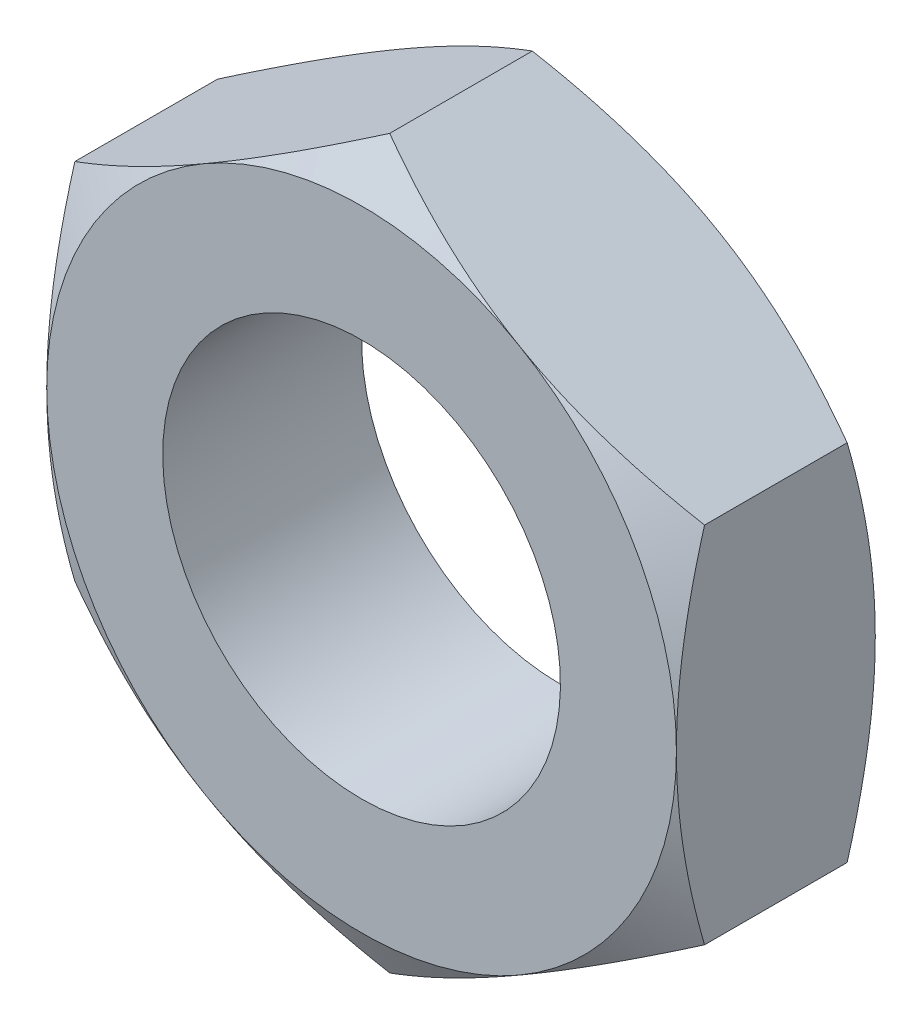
ISO-10303-21;
HEADER;
FILE_DESCRIPTION(('STEP AP214'),'2;1');
FILE_NAME('part.step','',(''),(''),'','','');
FILE_SCHEMA(('AUTOMOTIVE_DESIGN { 1 0 10303 214 1 1 1 1 }'));
ENDSEC;
DATA;
#1=APPLICATION_CONTEXT('core data for automotive mechanical design processes');
#2=APPLICATION_PROTOCOL_DEFINITION('international standard','automotive_design',2000,#1);
#3=PRODUCT_CONTEXT('',#1,'mechanical');
#4=PRODUCT('Part','Part','',(#3));
#5=PRODUCT_RELATED_PRODUCT_CATEGORY('part','',(#4));
#6=PRODUCT_DEFINITION_FORMATION('','',#4);
#7=PRODUCT_DEFINITION_CONTEXT('part definition',#1,'design');
#8=PRODUCT_DEFINITION('design','',#6,#7);
#9=PRODUCT_DEFINITION_SHAPE('','',#8);
#10=(LENGTH_UNIT() NAMED_UNIT(*) SI_UNIT(.MILLI.,.METRE.));
#11=(NAMED_UNIT(*) PLANE_ANGLE_UNIT() SI_UNIT($,.RADIAN.));
#12=(NAMED_UNIT(*) SI_UNIT($,.STERADIAN.) SOLID_ANGLE_UNIT());
#13=UNCERTAINTY_MEASURE_WITH_UNIT(LENGTH_MEASURE(1.E-05),#10,'distance_accuracy_value','');
#14=(GEOMETRIC_REPRESENTATION_CONTEXT(3) GLOBAL_UNCERTAINTY_ASSIGNED_CONTEXT((#13)) GLOBAL_UNIT_ASSIGNED_CONTEXT((#10,
#11,#12)) REPRESENTATION_CONTEXT('',''));
#15=CARTESIAN_POINT('',(0.,0.,0.));
#16=DIRECTION('',(0.,0.,1.));
#17=DIRECTION('',(1.,0.,0.));
#18=AXIS2_PLACEMENT_3D('',#15,#16,#17);
#19=CARTESIAN_POINT('',(6.,0.,0.));
#20=DIRECTION('',(0.,0.,-1.));
#21=DIRECTION('',(0.,1.,0.));
#22=AXIS2_PLACEMENT_3D('',#19,#20,#21);
#23=PLANE('',#22);
#24=CARTESIAN_POINT('',(0.,0.,0.));
#25=DIRECTION('',(0.,0.,-1.));
#26=DIRECTION('',(0.,1.,0.));
#27=AXIS2_PLACEMENT_3D('',#24,#25,#26);
#28=CIRCLE('',#27,6.);
#29=CARTESIAN_POINT('',(0.,6.,0.));
#30=VERTEX_POINT('',#29);
#31=EDGE_CURVE('E109',#30,#30,#28,.T.);
#32=ORIENTED_EDGE('',*,*,#31,.F.);
#33=EDGE_LOOP('',(#32));
#34=FACE_BOUND('',#33,.T.);
#35=CARTESIAN_POINT('',(0.,0.,0.));
#36=DIRECTION('',(0.,0.,1.));
#37=DIRECTION('',(-1.,0.,0.));
#38=AXIS2_PLACEMENT_3D('',#35,#36,#37);
#39=CIRCLE('',#38,9.5);
#40=CARTESIAN_POINT('',(-4.75,8.22724133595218,0.));
#41=VERTEX_POINT('',#40);
#42=CARTESIAN_POINT('',(-9.5,0.,0.));
#43=VERTEX_POINT('',#42);
#44=EDGE_CURVE('E415',#41,#43,#39,.T.);
#45=ORIENTED_EDGE('',*,*,#44,.F.);
#46=CARTESIAN_POINT('',(0.,0.,0.));
#47=DIRECTION('',(0.,0.,1.));
#48=DIRECTION('',(0.,-1.,0.));
#49=AXIS2_PLACEMENT_3D('',#46,#47,#48);
#50=CIRCLE('',#49,9.5);
#51=CARTESIAN_POINT('',(4.75,8.22724133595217,0.));
#52=VERTEX_POINT('',#51);
#53=EDGE_CURVE('E104',#52,#41,#50,.T.);
#54=ORIENTED_EDGE('',*,*,#53,.F.);
#55=CARTESIAN_POINT('',(0.,0.,0.));
#56=DIRECTION('',(0.,0.,1.));
#57=DIRECTION('',(-1.,0.,0.));
#58=AXIS2_PLACEMENT_3D('',#55,#56,#57);
#59=CIRCLE('',#58,9.5);
#60=CARTESIAN_POINT('',(9.5,0.,0.));
#61=VERTEX_POINT('',#60);
#62=EDGE_CURVE('E17',#61,#52,#59,.T.);
#63=ORIENTED_EDGE('',*,*,#62,.F.);
#64=CARTESIAN_POINT('',(0.,0.,0.));
#65=DIRECTION('',(0.,0.,1.));
#66=DIRECTION('',(-1.,0.,0.));
#67=AXIS2_PLACEMENT_3D('',#64,#65,#66);
#68=CIRCLE('',#67,9.5);
#69=CARTESIAN_POINT('',(4.75,-8.22724133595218,0.));
#70=VERTEX_POINT('',#69);
#71=EDGE_CURVE('E101',#70,#61,#68,.T.);
#72=ORIENTED_EDGE('',*,*,#71,.F.);
#73=CARTESIAN_POINT('',(0.,0.,0.));
#74=DIRECTION('',(0.,0.,1.));
#75=DIRECTION('',(0.,-1.,0.));
#76=AXIS2_PLACEMENT_3D('',#73,#74,#75);
#77=CIRCLE('',#76,9.5);
#78=CARTESIAN_POINT('',(-4.75,-8.22724133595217,0.));
#79=VERTEX_POINT('',#78);
#80=EDGE_CURVE('E119',#79,#70,#77,.T.);
#81=ORIENTED_EDGE('',*,*,#80,.F.);
#82=CARTESIAN_POINT('',(0.,0.,0.));
#83=DIRECTION('',(0.,0.,1.));
#84=DIRECTION('',(-1.,0.,0.));
#85=AXIS2_PLACEMENT_3D('',#82,#83,#84);
#86=CIRCLE('',#85,9.5);
#87=EDGE_CURVE('E417',#43,#79,#86,.T.);
#88=ORIENTED_EDGE('',*,*,#87,.F.);
#89=EDGE_LOOP('',(#45,#54,#63,#72,#81,#88));
#90=FACE_BOUND('',#89,.T.);
#91=ADVANCED_FACE('F14',(#34,#90),#23,.T.);
#92=CARTESIAN_POINT('',(0.,0.,0.853596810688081));
#93=DIRECTION('',(0.,0.,1.));
#94=DIRECTION('',(-1.,0.,0.));
#95=AXIS2_PLACEMENT_3D('',#92,#93,#94);
#96=CONICAL_SURFACE('',#95,10.9784730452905,1.0471975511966);
#97=CARTESIAN_POINT('',(9.5,5.48482755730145,0.848505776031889));
#98=CARTESIAN_POINT('',(9.11335202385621,5.70805887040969,0.719590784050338));
#99=CARTESIAN_POINT('',(8.72360763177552,5.93307790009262,0.601482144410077));
#100=CARTESIAN_POINT('',(7.94068328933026,6.38509947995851,0.393199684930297));
#101=CARTESIAN_POINT('',(7.54753064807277,6.61208626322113,0.302887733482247));
#102=CARTESIAN_POINT('',(6.954091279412,6.95470864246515,0.191999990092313));
#103=CARTESIAN_POINT('',(6.75552851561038,7.06934890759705,0.159120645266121));
#104=CARTESIAN_POINT('',(6.35745238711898,7.29917826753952,0.102205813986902));
#105=CARTESIAN_POINT('',(6.15793904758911,7.41436734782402,0.0781700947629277));
#106=CARTESIAN_POINT('',(5.75722379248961,7.6457204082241,0.0393648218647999));
#107=CARTESIAN_POINT('',(5.55601842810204,7.76188637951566,0.0246423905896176));
#108=CARTESIAN_POINT('',(5.15321199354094,7.99444678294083,0.00493960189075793));
#109=CARTESIAN_POINT('',(4.95161085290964,8.11084125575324,-3.88261459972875E-05));
#110=CARTESIAN_POINT('',(4.75,8.22724133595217,0.));
#111=B_SPLINE_CURVE_WITH_KNOTS('',3,(#97,#98,#99,#100,#101,#102,#103,#104,#105,#106,#107,#108,
#109,#110),.UNSPECIFIED.,.F.,.F.,(4,2,2,2,2,2,4),(0.,1.39466965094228,2.78229242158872,
3.47701423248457,4.17171775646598,4.86990873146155,5.56823793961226),.UNSPECIFIED.);
#112=CARTESIAN_POINT('',(9.5,5.48482755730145,0.848505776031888));
#113=VERTEX_POINT('',#112);
#114=EDGE_CURVE('E124',#113,#52,#111,.T.);
#115=ORIENTED_EDGE('',*,*,#114,.F.);
#116=CARTESIAN_POINT('',(9.5,0.,0.));
#117=CARTESIAN_POINT('',(9.5,0.232800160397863,-3.88261460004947E-05));
#118=CARTESIAN_POINT('',(9.5,0.465589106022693,0.00493960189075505));
#119=CARTESIAN_POINT('',(9.5,0.930709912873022,0.0246423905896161));
#120=CARTESIAN_POINT('',(9.5,1.16304185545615,0.0393648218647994));
#121=CARTESIAN_POINT('',(9.5,1.62574797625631,0.0781700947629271));
#122=CARTESIAN_POINT('',(9.5,1.8561261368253,0.1022058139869));
#123=CARTESIAN_POINT('',(9.5,2.31578485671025,0.159120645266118));
#124=CARTESIAN_POINT('',(9.5,2.54506538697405,0.191999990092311));
#125=CARTESIAN_POINT('',(9.5,3.23031014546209,0.302887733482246));
#126=CARTESIAN_POINT('',(9.5,3.68428371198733,0.393199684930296));
#127=CARTESIAN_POINT('',(9.5,4.5883268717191,0.601482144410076));
#128=CARTESIAN_POINT('',(9.5,5.03836493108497,0.719590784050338));
#129=CARTESIAN_POINT('',(9.5,5.48482755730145,0.848505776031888));
#130=B_SPLINE_CURVE_WITH_KNOTS('',3,(#116,#117,#118,#119,#120,#121,#122,#123,#124,#125,#126,
#127,#128,#129),.UNSPECIFIED.,.F.,.F.,(4,2,2,2,2,2,4),(0.,0.698329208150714,1.39652018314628,
2.09122370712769,2.78594551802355,4.17356828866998,5.56823793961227),.UNSPECIFIED.);
#131=EDGE_CURVE('E121',#61,#113,#130,.T.);
#132=ORIENTED_EDGE('',*,*,#131,.F.);
#133=ORIENTED_EDGE('',*,*,#62,.T.);
#134=EDGE_LOOP('',(#115,#132,#133));
#135=FACE_BOUND('',#134,.T.);
#136=ADVANCED_FACE('F122',(#135),#96,.T.);
#137=CARTESIAN_POINT('',(0.,0.,0.853596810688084));
#138=DIRECTION('',(0.,0.,1.));
#139=DIRECTION('',(0.,-1.,0.));
#140=AXIS2_PLACEMENT_3D('',#137,#138,#139);
#141=CONICAL_SURFACE('',#140,10.9784730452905,1.0471975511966);
#142=CARTESIAN_POINT('',(0.,10.9696551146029,0.848505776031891));
#143=CARTESIAN_POINT('',(-0.386647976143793,10.7464238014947,0.719590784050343));
#144=CARTESIAN_POINT('',(-0.776392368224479,10.5214047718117,0.601482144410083));
#145=CARTESIAN_POINT('',(-1.55931671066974,10.0693831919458,0.393199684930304));
#146=CARTESIAN_POINT('',(-1.95246935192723,9.84239640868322,0.302887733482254));
#147=CARTESIAN_POINT('',(-2.545908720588,9.4997740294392,0.191999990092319));
#148=CARTESIAN_POINT('',(-2.74447148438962,9.3851337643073,0.159120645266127));
#149=CARTESIAN_POINT('',(-3.14254761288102,9.15530440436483,0.102205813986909));
#150=CARTESIAN_POINT('',(-3.34206095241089,9.04011532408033,0.0781700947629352));
#151=CARTESIAN_POINT('',(-3.74277620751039,8.80876226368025,0.0393648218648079));
#152=CARTESIAN_POINT('',(-3.94398157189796,8.69259629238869,0.0246423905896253));
#153=CARTESIAN_POINT('',(-4.34678800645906,8.46003588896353,0.00493960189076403));
#154=CARTESIAN_POINT('',(-4.54838914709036,8.34364141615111,-3.88261459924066E-05));
#155=CARTESIAN_POINT('',(-4.75,8.22724133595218,0.));
#156=B_SPLINE_CURVE_WITH_KNOTS('',3,(#142,#143,#144,#145,#146,#147,#148,#149,#150,#151,#152,
#153,#154,#155),.UNSPECIFIED.,.F.,.F.,(4,2,2,2,2,2,4),(0.,1.39466965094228,2.78229242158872,
3.47701423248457,4.17171775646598,4.86990873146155,5.56823793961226),.UNSPECIFIED.);
#157=CARTESIAN_POINT('',(0.,10.9696551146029,0.848505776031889));
#158=VERTEX_POINT('',#157);
#159=EDGE_CURVE('E294',#158,#41,#156,.T.);
#160=ORIENTED_EDGE('',*,*,#159,.F.);
#161=CARTESIAN_POINT('',(4.75,8.22724133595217,0.));
#162=CARTESIAN_POINT('',(4.54838914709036,8.3436414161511,-3.88261459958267E-05));
#163=CARTESIAN_POINT('',(4.34678800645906,8.46003588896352,0.00493960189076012));
#164=CARTESIAN_POINT('',(3.94398157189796,8.69259629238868,0.0246423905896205));
#165=CARTESIAN_POINT('',(3.74277620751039,8.80876226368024,0.0393648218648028));
#166=CARTESIAN_POINT('',(3.34206095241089,9.04011532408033,0.0781700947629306));
#167=CARTESIAN_POINT('',(3.14254761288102,9.15530440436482,0.102205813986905));
#168=CARTESIAN_POINT('',(2.74447148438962,9.38513376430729,0.159120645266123));
#169=CARTESIAN_POINT('',(2.545908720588,9.49977402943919,0.191999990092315));
#170=CARTESIAN_POINT('',(1.95246935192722,9.84239640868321,0.30288773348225));
#171=CARTESIAN_POINT('',(1.55931671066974,10.0693831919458,0.393199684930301));
#172=CARTESIAN_POINT('',(0.776392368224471,10.5214047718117,0.601482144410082));
#173=CARTESIAN_POINT('',(0.386647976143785,10.7464238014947,0.719590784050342));
#174=CARTESIAN_POINT('',(0.,10.9696551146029,0.848505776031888));
#175=B_SPLINE_CURVE_WITH_KNOTS('',3,(#161,#162,#163,#164,#165,#166,#167,#168,#169,#170,#171,
#172,#173,#174),.UNSPECIFIED.,.F.,.F.,(4,2,2,2,2,2,4),(0.,0.698329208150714,1.39652018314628,
2.09122370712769,2.78594551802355,4.17356828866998,5.56823793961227),.UNSPECIFIED.);
#176=EDGE_CURVE('E302',#52,#158,#175,.T.);
#177=ORIENTED_EDGE('',*,*,#176,.F.);
#178=ORIENTED_EDGE('',*,*,#53,.T.);
#179=EDGE_LOOP('',(#160,#177,#178));
#180=FACE_BOUND('',#179,.T.);
#181=ADVANCED_FACE('F283',(#180),#141,.T.);
#182=CARTESIAN_POINT('',(0.,0.,0.853596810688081));
#183=DIRECTION('',(0.,0.,1.));
#184=DIRECTION('',(-1.,0.,0.));
#185=AXIS2_PLACEMENT_3D('',#182,#183,#184);
#186=CONICAL_SURFACE('',#185,10.9784730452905,1.0471975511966);
#187=CARTESIAN_POINT('',(-9.5,5.48482755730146,0.848505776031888));
#188=CARTESIAN_POINT('',(-9.5,5.03836493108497,0.719590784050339));
#189=CARTESIAN_POINT('',(-9.5,4.58832687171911,0.601482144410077));
#190=CARTESIAN_POINT('',(-9.5,3.68428371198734,0.393199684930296));
#191=CARTESIAN_POINT('',(-9.5,3.23031014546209,0.302887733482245));
#192=CARTESIAN_POINT('',(-9.5,2.54506538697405,0.19199999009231));
#193=CARTESIAN_POINT('',(-9.5,2.31578485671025,0.159120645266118));
#194=CARTESIAN_POINT('',(-9.5,1.8561261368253,0.1022058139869));
#195=CARTESIAN_POINT('',(-9.5,1.62574797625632,0.0781700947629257));
#196=CARTESIAN_POINT('',(-9.5,1.16304185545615,0.0393648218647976));
#197=CARTESIAN_POINT('',(-9.5,0.930709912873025,0.0246423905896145));
#198=CARTESIAN_POINT('',(-9.5,0.465589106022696,0.00493960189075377));
#199=CARTESIAN_POINT('',(-9.5,0.232800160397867,-3.88261460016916E-05));
#200=CARTESIAN_POINT('',(-9.5,0.,0.));
#201=B_SPLINE_CURVE_WITH_KNOTS('',3,(#187,#188,#189,#190,#191,#192,#193,#194,#195,#196,#197,
#198,#199,#200),.UNSPECIFIED.,.F.,.F.,(4,2,2,2,2,2,4),(0.,1.39466965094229,2.78229242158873,
3.47701423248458,4.17171775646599,4.86990873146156,5.56823793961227),.UNSPECIFIED.);
#202=CARTESIAN_POINT('',(-9.5,5.48482755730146,0.848505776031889));
#203=VERTEX_POINT('',#202);
#204=EDGE_CURVE('E262',#203,#43,#201,.T.);
#205=ORIENTED_EDGE('',*,*,#204,.F.);
#206=CARTESIAN_POINT('',(-4.75,8.22724133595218,0.));
#207=CARTESIAN_POINT('',(-4.95161085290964,8.11084125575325,-3.88261459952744E-05));
#208=CARTESIAN_POINT('',(-5.15321199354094,7.99444678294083,0.00493960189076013));
#209=CARTESIAN_POINT('',(-5.55601842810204,7.76188637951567,0.0246423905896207));
#210=CARTESIAN_POINT('',(-5.75722379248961,7.64572040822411,0.0393648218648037));
#211=CARTESIAN_POINT('',(-6.15793904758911,7.41436734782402,0.0781700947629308));
#212=CARTESIAN_POINT('',(-6.35745238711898,7.29917826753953,0.102205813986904));
#213=CARTESIAN_POINT('',(-6.75552851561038,7.06934890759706,0.159120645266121));
#214=CARTESIAN_POINT('',(-6.95409127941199,6.95470864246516,0.191999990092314));
#215=CARTESIAN_POINT('',(-7.54753064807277,6.61208626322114,0.302887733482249));
#216=CARTESIAN_POINT('',(-7.94068328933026,6.38509947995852,0.393199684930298));
#217=CARTESIAN_POINT('',(-8.72360763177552,5.93307790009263,0.601482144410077));
#218=CARTESIAN_POINT('',(-9.11335202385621,5.7080588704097,0.719590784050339));
#219=CARTESIAN_POINT('',(-9.5,5.48482755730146,0.848505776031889));
#220=B_SPLINE_CURVE_WITH_KNOTS('',3,(#206,#207,#208,#209,#210,#211,#212,#213,#214,#215,#216,
#217,#218,#219),.UNSPECIFIED.,.F.,.F.,(4,2,2,2,2,2,4),(0.,0.698329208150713,1.39652018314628,
2.09122370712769,2.78594551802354,4.17356828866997,5.56823793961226),.UNSPECIFIED.);
#221=EDGE_CURVE('E287',#41,#203,#220,.T.);
#222=ORIENTED_EDGE('',*,*,#221,.F.);
#223=ORIENTED_EDGE('',*,*,#44,.T.);
#224=EDGE_LOOP('',(#205,#222,#223));
#225=FACE_BOUND('',#224,.T.);
#226=ADVANCED_FACE('F277',(#225),#186,.T.);
#227=CARTESIAN_POINT('',(0.,0.,0.853596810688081));
#228=DIRECTION('',(0.,0.,1.));
#229=DIRECTION('',(-1.,0.,0.));
#230=AXIS2_PLACEMENT_3D('',#227,#228,#229);
#231=CONICAL_SURFACE('',#230,10.9784730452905,1.0471975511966);
#232=CARTESIAN_POINT('',(-9.5,0.,0.));
#233=CARTESIAN_POINT('',(-9.5,-0.232800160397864,-3.88261460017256E-05));
#234=CARTESIAN_POINT('',(-9.5,-0.465589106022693,0.00493960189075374));
#235=CARTESIAN_POINT('',(-9.5,-0.930709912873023,0.0246423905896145));
#236=CARTESIAN_POINT('',(-9.5,-1.16304185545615,0.0393648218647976));
#237=CARTESIAN_POINT('',(-9.5,-1.62574797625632,0.0781700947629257));
#238=CARTESIAN_POINT('',(-9.5,-1.8561261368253,0.1022058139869));
#239=CARTESIAN_POINT('',(-9.5,-2.31578485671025,0.159120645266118));
#240=CARTESIAN_POINT('',(-9.5,-2.54506538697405,0.19199999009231));
#241=CARTESIAN_POINT('',(-9.5,-3.23031014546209,0.302887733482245));
#242=CARTESIAN_POINT('',(-9.5,-3.68428371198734,0.393199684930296));
#243=CARTESIAN_POINT('',(-9.5,-4.58832687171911,0.601482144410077));
#244=CARTESIAN_POINT('',(-9.5,-5.03836493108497,0.719590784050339));
#245=CARTESIAN_POINT('',(-9.5,-5.48482755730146,0.848505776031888));
#246=B_SPLINE_CURVE_WITH_KNOTS('',3,(#232,#233,#234,#235,#236,#237,#238,#239,#240,#241,#242,
#243,#244,#245),.UNSPECIFIED.,.F.,.F.,(4,2,2,2,2,2,4),(0.,0.698329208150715,1.39652018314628,
2.09122370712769,2.78594551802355,4.17356828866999,5.56823793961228),.UNSPECIFIED.);
#247=CARTESIAN_POINT('',(-9.5,-5.48482755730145,0.848505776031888));
#248=VERTEX_POINT('',#247);
#249=EDGE_CURVE('E255',#43,#248,#246,.T.);
#250=ORIENTED_EDGE('',*,*,#249,.F.);
#251=ORIENTED_EDGE('',*,*,#87,.T.);
#252=CARTESIAN_POINT('',(-9.5,-5.48482755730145,0.848505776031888));
#253=CARTESIAN_POINT('',(-9.11335202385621,-5.70805887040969,0.719590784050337));
#254=CARTESIAN_POINT('',(-8.72360763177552,-5.93307790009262,0.601482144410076));
#255=CARTESIAN_POINT('',(-7.94068328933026,-6.38509947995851,0.393199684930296));
#256=CARTESIAN_POINT('',(-7.54753064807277,-6.61208626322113,0.302887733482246));
#257=CARTESIAN_POINT('',(-6.954091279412,-6.95470864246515,0.191999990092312));
#258=CARTESIAN_POINT('',(-6.75552851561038,-7.06934890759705,0.159120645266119));
#259=CARTESIAN_POINT('',(-6.35745238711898,-7.29917826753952,0.102205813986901));
#260=CARTESIAN_POINT('',(-6.15793904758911,-7.41436734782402,0.0781700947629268));
#261=CARTESIAN_POINT('',(-5.75722379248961,-7.6457204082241,0.0393648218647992));
#262=CARTESIAN_POINT('',(-5.55601842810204,-7.76188637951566,0.0246423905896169));
#263=CARTESIAN_POINT('',(-5.15321199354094,-7.99444678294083,0.00493960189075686));
#264=CARTESIAN_POINT('',(-4.95161085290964,-8.11084125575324,-3.88261459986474E-05));
#265=CARTESIAN_POINT('',(-4.75,-8.22724133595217,0.));
#266=B_SPLINE_CURVE_WITH_KNOTS('',3,(#252,#253,#254,#255,#256,#257,#258,#259,#260,#261,#262,
#263,#264,#265),.UNSPECIFIED.,.F.,.F.,(4,2,2,2,2,2,4),(0.,1.39466965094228,2.78229242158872,
3.47701423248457,4.17171775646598,4.86990873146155,5.56823793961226),.UNSPECIFIED.);
#267=EDGE_CURVE('E263',#248,#79,#266,.T.);
#268=ORIENTED_EDGE('',*,*,#267,.F.);
#269=EDGE_LOOP('',(#250,#251,#268));
#270=FACE_BOUND('',#269,.T.);
#271=ADVANCED_FACE('F274',(#270),#231,.T.);
#272=CARTESIAN_POINT('',(0.,0.,0.853596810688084));
#273=DIRECTION('',(0.,0.,1.));
#274=DIRECTION('',(0.,-1.,0.));
#275=AXIS2_PLACEMENT_3D('',#272,#273,#274);
#276=CONICAL_SURFACE('',#275,10.9784730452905,1.0471975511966);
#277=CARTESIAN_POINT('',(0.,-10.9696551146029,0.848505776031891));
#278=CARTESIAN_POINT('',(0.386647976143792,-10.7464238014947,0.719590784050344));
#279=CARTESIAN_POINT('',(0.776392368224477,-10.5214047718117,0.601482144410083));
#280=CARTESIAN_POINT('',(1.55931671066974,-10.0693831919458,0.393199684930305));
#281=CARTESIAN_POINT('',(1.95246935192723,-9.84239640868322,0.302887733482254));
#282=CARTESIAN_POINT('',(2.545908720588,-9.4997740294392,0.191999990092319));
#283=CARTESIAN_POINT('',(2.74447148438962,-9.3851337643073,0.159120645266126));
#284=CARTESIAN_POINT('',(3.14254761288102,-9.15530440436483,0.102205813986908));
#285=CARTESIAN_POINT('',(3.34206095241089,-9.04011532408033,0.0781700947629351));
#286=CARTESIAN_POINT('',(3.74277620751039,-8.80876226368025,0.039364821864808));
#287=CARTESIAN_POINT('',(3.94398157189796,-8.69259629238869,0.0246423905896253));
#288=CARTESIAN_POINT('',(4.34678800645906,-8.46003588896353,0.0049396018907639));
#289=CARTESIAN_POINT('',(4.54838914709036,-8.34364141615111,-3.88261459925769E-05));
#290=CARTESIAN_POINT('',(4.75,-8.22724133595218,0.));
#291=B_SPLINE_CURVE_WITH_KNOTS('',3,(#277,#278,#279,#280,#281,#282,#283,#284,#285,#286,#287,
#288,#289,#290),.UNSPECIFIED.,.F.,.F.,(4,2,2,2,2,2,4),(0.,1.39466965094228,2.78229242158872,
3.47701423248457,4.17171775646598,4.86990873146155,5.56823793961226),.UNSPECIFIED.);
#292=CARTESIAN_POINT('',(0.,-10.9696551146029,0.848505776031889));
#293=VERTEX_POINT('',#292);
#294=EDGE_CURVE('E163',#293,#70,#291,.T.);
#295=ORIENTED_EDGE('',*,*,#294,.F.);
#296=CARTESIAN_POINT('',(-4.75,-8.22724133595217,0.));
#297=CARTESIAN_POINT('',(-4.54838914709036,-8.3436414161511,-3.88261459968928E-05));
#298=CARTESIAN_POINT('',(-4.34678800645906,-8.46003588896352,0.00493960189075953));
#299=CARTESIAN_POINT('',(-3.94398157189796,-8.69259629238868,0.0246423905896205));
#300=CARTESIAN_POINT('',(-3.74277620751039,-8.80876226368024,0.0393648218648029));
#301=CARTESIAN_POINT('',(-3.34206095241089,-9.04011532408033,0.0781700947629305));
#302=CARTESIAN_POINT('',(-3.14254761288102,-9.15530440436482,0.102205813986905));
#303=CARTESIAN_POINT('',(-2.74447148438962,-9.38513376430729,0.159120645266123));
#304=CARTESIAN_POINT('',(-2.545908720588,-9.49977402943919,0.191999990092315));
#305=CARTESIAN_POINT('',(-1.95246935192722,-9.84239640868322,0.30288773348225));
#306=CARTESIAN_POINT('',(-1.55931671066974,-10.0693831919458,0.393199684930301));
#307=CARTESIAN_POINT('',(-0.776392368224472,-10.5214047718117,0.601482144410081));
#308=CARTESIAN_POINT('',(-0.386647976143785,-10.7464238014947,0.719590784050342));
#309=CARTESIAN_POINT('',(0.,-10.9696551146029,0.848505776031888));
#310=B_SPLINE_CURVE_WITH_KNOTS('',3,(#296,#297,#298,#299,#300,#301,#302,#303,#304,#305,#306,
#307,#308,#309),.UNSPECIFIED.,.F.,.F.,(4,2,2,2,2,2,4),(0.,0.698329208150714,1.39652018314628,
2.09122370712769,2.78594551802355,4.17356828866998,5.56823793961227),.UNSPECIFIED.);
#311=EDGE_CURVE('E368',#79,#293,#310,.T.);
#312=ORIENTED_EDGE('',*,*,#311,.F.);
#313=ORIENTED_EDGE('',*,*,#80,.T.);
#314=EDGE_LOOP('',(#295,#312,#313));
#315=FACE_BOUND('',#314,.T.);
#316=ADVANCED_FACE('F150',(#315),#276,.T.);
#317=CARTESIAN_POINT('',(0.,0.,0.853596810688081));
#318=DIRECTION('',(0.,0.,1.));
#319=DIRECTION('',(-1.,0.,0.));
#320=AXIS2_PLACEMENT_3D('',#317,#318,#319);
#321=CONICAL_SURFACE('',#320,10.9784730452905,1.0471975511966);
#322=CARTESIAN_POINT('',(9.5,-5.48482755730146,0.848505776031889));
#323=CARTESIAN_POINT('',(9.5,-5.03836493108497,0.71959078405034));
#324=CARTESIAN_POINT('',(9.5,-4.58832687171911,0.601482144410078));
#325=CARTESIAN_POINT('',(9.5,-3.68428371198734,0.393199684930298));
#326=CARTESIAN_POINT('',(9.5,-3.23031014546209,0.302887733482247));
#327=CARTESIAN_POINT('',(9.5,-2.54506538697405,0.191999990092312));
#328=CARTESIAN_POINT('',(9.5,-2.31578485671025,0.159120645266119));
#329=CARTESIAN_POINT('',(9.5,-1.8561261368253,0.102205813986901));
#330=CARTESIAN_POINT('',(9.5,-1.62574797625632,0.0781700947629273));
#331=CARTESIAN_POINT('',(9.5,-1.16304185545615,0.0393648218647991));
#332=CARTESIAN_POINT('',(9.5,-0.930709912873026,0.0246423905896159));
#333=CARTESIAN_POINT('',(9.5,-0.465589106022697,0.00493960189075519));
#334=CARTESIAN_POINT('',(9.5,-0.232800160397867,-3.88261460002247E-05));
#335=CARTESIAN_POINT('',(9.5,0.,0.));
#336=B_SPLINE_CURVE_WITH_KNOTS('',3,(#322,#323,#324,#325,#326,#327,#328,#329,#330,#331,#332,
#333,#334,#335),.UNSPECIFIED.,.F.,.F.,(4,2,2,2,2,2,4),(0.,1.39466965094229,2.78229242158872,
3.47701423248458,4.17171775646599,4.86990873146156,5.56823793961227),.UNSPECIFIED.);
#337=CARTESIAN_POINT('',(9.5,-5.48482755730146,0.848505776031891));
#338=VERTEX_POINT('',#337);
#339=EDGE_CURVE('E114',#338,#61,#336,.T.);
#340=ORIENTED_EDGE('',*,*,#339,.F.);
#341=CARTESIAN_POINT('',(4.75,-8.22724133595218,0.));
#342=CARTESIAN_POINT('',(4.95161085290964,-8.11084125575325,-3.88261459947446E-05));
#343=CARTESIAN_POINT('',(5.15321199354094,-7.99444678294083,0.00493960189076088));
#344=CARTESIAN_POINT('',(5.55601842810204,-7.76188637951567,0.0246423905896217));
#345=CARTESIAN_POINT('',(5.75722379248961,-7.64572040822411,0.0393648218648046));
#346=CARTESIAN_POINT('',(6.15793904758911,-7.41436734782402,0.0781700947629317));
#347=CARTESIAN_POINT('',(6.35745238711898,-7.29917826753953,0.102205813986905));
#348=CARTESIAN_POINT('',(6.75552851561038,-7.06934890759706,0.159120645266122));
#349=CARTESIAN_POINT('',(6.95409127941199,-6.95470864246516,0.191999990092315));
#350=CARTESIAN_POINT('',(7.54753064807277,-6.61208626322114,0.30288773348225));
#351=CARTESIAN_POINT('',(7.94068328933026,-6.38509947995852,0.3931996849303));
#352=CARTESIAN_POINT('',(8.72360763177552,-5.93307790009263,0.601482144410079));
#353=CARTESIAN_POINT('',(9.11335202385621,-5.7080588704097,0.719590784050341));
#354=CARTESIAN_POINT('',(9.5,-5.48482755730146,0.848505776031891));
#355=B_SPLINE_CURVE_WITH_KNOTS('',3,(#341,#342,#343,#344,#345,#346,#347,#348,#349,#350,#351,
#352,#353,#354),.UNSPECIFIED.,.F.,.F.,(4,2,2,2,2,2,4),(0.,0.698329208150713,1.39652018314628,
2.09122370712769,2.78594551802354,4.17356828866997,5.56823793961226),.UNSPECIFIED.);
#356=EDGE_CURVE('E117',#70,#338,#355,.T.);
#357=ORIENTED_EDGE('',*,*,#356,.F.);
#358=ORIENTED_EDGE('',*,*,#71,.T.);
#359=EDGE_LOOP('',(#340,#357,#358));
#360=FACE_BOUND('',#359,.T.);
#361=ADVANCED_FACE('F112',(#360),#321,.T.);
#362=CARTESIAN_POINT('',(9.5,-5.48482755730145,0.));
#363=DIRECTION('',(1.,0.,0.));
#364=DIRECTION('',(0.,1.,0.));
#365=AXIS2_PLACEMENT_3D('',#362,#363,#364);
#366=PLANE('',#365);
#367=ORIENTED_EDGE('',*,*,#339,.T.);
#368=ORIENTED_EDGE('',*,*,#131,.T.);
#369=DIRECTION('',(0.,0.,1.));
#370=VECTOR('',#369,1.);
#371=CARTESIAN_POINT('',(9.5,5.48482755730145,0.));
#372=LINE('',#371,#370);
#373=CARTESIAN_POINT('',(9.50000001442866,5.48482754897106,5.15149421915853));
#374=VERTEX_POINT('',#373);
#375=EDGE_CURVE('E127',#374,#113,#372,.F.);
#376=ORIENTED_EDGE('',*,*,#375,.F.);
#377=CARTESIAN_POINT('',(9.5,0.,6.));
#378=CARTESIAN_POINT('',(9.5,0.23280015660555,6.0000388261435));
#379=CARTESIAN_POINT('',(9.5,0.465589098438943,5.99506039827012));
#380=CARTESIAN_POINT('',(9.5,0.930709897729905,5.97535761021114));
#381=CARTESIAN_POINT('',(9.5,1.16304183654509,5.96063517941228));
#382=CARTESIAN_POINT('',(9.5,1.62574794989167,5.92182990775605));
#383=CARTESIAN_POINT('',(9.5,1.85612610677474,5.89779418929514));
#384=CARTESIAN_POINT('',(9.5,2.31578481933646,5.84087935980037));
#385=CARTESIAN_POINT('',(9.5,2.54506534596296,5.8080000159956));
#386=CARTESIAN_POINT('',(9.5,3.23031009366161,5.6971122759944));
#387=CARTESIAN_POINT('',(9.5,3.68428365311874,5.60680032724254));
#388=CARTESIAN_POINT('',(9.5,4.58832679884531,5.39851787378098));
#389=CARTESIAN_POINT('',(9.5,5.03836485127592,5.28040923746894));
#390=CARTESIAN_POINT('',(9.5,5.48482747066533,5.15149424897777));
#391=B_SPLINE_CURVE_WITH_KNOTS('',3,(#377,#378,#379,#380,#381,#382,#383,#384,#385,#386,#387,
#388,#389,#390),.UNSPECIFIED.,.F.,.F.,(4,2,2,2,2,2,4),(0.,0.698329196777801,1.39652016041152,
2.09122367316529,2.78594547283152,4.17356822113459,5.5682378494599),.UNSPECIFIED.);
#392=CARTESIAN_POINT('',(9.5,0.,6.));
#393=VERTEX_POINT('',#392);
#394=EDGE_CURVE('E348',#393,#374,#391,.T.);
#395=ORIENTED_EDGE('',*,*,#394,.F.);
#396=CARTESIAN_POINT('',(9.49999996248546,-5.48482758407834,5.15149419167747));
#397=CARTESIAN_POINT('',(9.49999998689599,-5.03836495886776,5.28040919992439));
#398=CARTESIAN_POINT('',(9.49999999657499,-4.58832689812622,5.39851784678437));
#399=CARTESIAN_POINT('',(9.50000000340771,-3.68428373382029,5.6068003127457));
#400=CARTESIAN_POINT('',(9.50000000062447,-3.23031016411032,5.69711226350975));
#401=CARTESIAN_POINT('',(9.49999999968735,-2.54506540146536,5.80800000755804));
#402=CARTESIAN_POINT('',(9.49999999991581,-2.31578487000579,5.84087935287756));
#403=CARTESIAN_POINT('',(9.50000000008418,-1.85612614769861,5.89779418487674));
#404=CARTESIAN_POINT('',(9.5000000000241,-1.62574798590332,5.92182990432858));
#405=CARTESIAN_POINT('',(9.49999999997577,-1.16304186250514,5.9606351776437));
#406=CARTESIAN_POINT('',(9.49999999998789,-0.930709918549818,5.97535760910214));
#407=CARTESIAN_POINT('',(9.50000000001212,-0.465589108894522,5.9950603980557));
#408=CARTESIAN_POINT('',(9.50000000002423,-0.232800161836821,6.00003882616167));
#409=CARTESIAN_POINT('',(9.5,0.,6.));
#410=B_SPLINE_CURVE_WITH_KNOTS('',3,(#396,#397,#398,#399,#400,#401,#402,#403,#404,#405,#406,
#407,#408,#409),.UNSPECIFIED.,.F.,.F.,(4,2,2,2,2,2,4),(0.,1.39466966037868,2.78229243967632,
3.4770142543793,4.17171778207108,4.86990876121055,5.5682379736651),.UNSPECIFIED.);
#411=CARTESIAN_POINT('',(9.5,-5.48482757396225,5.15149421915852));
#412=VERTEX_POINT('',#411);
#413=EDGE_CURVE('E354',#412,#393,#410,.T.);
#414=ORIENTED_EDGE('',*,*,#413,.F.);
#415=DIRECTION('',(0.,0.,1.));
#416=VECTOR('',#415,1.);
#417=CARTESIAN_POINT('',(9.5,-5.48482755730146,0.));
#418=LINE('',#417,#416);
#419=EDGE_CURVE('E131',#338,#412,#418,.T.);
#420=ORIENTED_EDGE('',*,*,#419,.F.);
#421=EDGE_LOOP('',(#367,#368,#376,#395,#414,#420));
#422=FACE_BOUND('',#421,.T.);
#423=ADVANCED_FACE('F129',(#422),#366,.T.);
#424=CARTESIAN_POINT('',(9.5,5.48482755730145,0.));
#425=DIRECTION('',(0.5,0.866025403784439,0.));
#426=DIRECTION('',(-0.866025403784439,0.5,0.));
#427=AXIS2_PLACEMENT_3D('',#424,#425,#426);
#428=PLANE('',#427);
#429=ORIENTED_EDGE('',*,*,#114,.T.);
#430=ORIENTED_EDGE('',*,*,#176,.T.);
#431=DIRECTION('',(0.,0.,1.));
#432=VECTOR('',#431,1.);
#433=CARTESIAN_POINT('',(0.,10.9696551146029,0.));
#434=LINE('',#433,#432);
#435=CARTESIAN_POINT('',(-1.15429505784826E-08,10.9696551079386,5.15149422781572));
#436=VERTEX_POINT('',#435);
#437=EDGE_CURVE('E301',#436,#158,#434,.F.);
#438=ORIENTED_EDGE('',*,*,#437,.F.);
#439=CARTESIAN_POINT('',(4.75,8.22724133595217,6.));
#440=CARTESIAN_POINT('',(4.54838914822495,8.34364141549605,6.00003882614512));
#441=CARTESIAN_POINT('',(4.34678800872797,8.46003588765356,5.99506039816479));
#442=CARTESIAN_POINT('',(3.94398157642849,8.69259628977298,5.97535760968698));
#443=CARTESIAN_POINT('',(3.74277621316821,8.8087622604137,5.96063517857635));
#444=CARTESIAN_POINT('',(3.34206096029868,9.04011531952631,5.92182990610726));
#445=CARTESIAN_POINT('',(3.14254762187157,9.15530439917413,5.89779418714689));
#446=CARTESIAN_POINT('',(2.74447149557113,9.38513375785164,5.84087935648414));
#447=CARTESIAN_POINT('',(2.54590873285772,9.49977402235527,5.80800001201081));
#448=CARTESIAN_POINT('',(1.95246936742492,9.84239639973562,5.69711226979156));
#449=CARTESIAN_POINT('',(1.55931672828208,10.0693831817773,5.60680031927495));
#450=CARTESIAN_POINT('',(0.776392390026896,10.5214047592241,5.39851786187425));
#451=CARTESIAN_POINT('',(0.386648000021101,10.7464237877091,5.28040922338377));
#452=CARTESIAN_POINT('',(2.59198323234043E-08,10.9696550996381,5.15149423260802));
#453=B_SPLINE_CURVE_WITH_KNOTS('',3,(#439,#440,#441,#442,#443,#444,#445,#446,#447,#448,#449,
#450,#451,#452),.UNSPECIFIED.,.F.,.F.,(4,2,2,2,2,2,4),(0.,0.698329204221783,1.39652017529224,
2.0912236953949,2.78594550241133,4.17356826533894,5.56823790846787),.UNSPECIFIED.);
#454=CARTESIAN_POINT('',(4.75,8.22724133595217,6.));
#455=VERTEX_POINT('',#454);
#456=EDGE_CURVE('E326',#455,#436,#453,.T.);
#457=ORIENTED_EDGE('',*,*,#456,.F.);
#458=CARTESIAN_POINT('',(9.50000000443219,5.48482751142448,5.15149419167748));
#459=CARTESIAN_POINT('',(9.1133520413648,5.7080588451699,5.28040919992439));
#460=CARTESIAN_POINT('',(8.72360765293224,5.93307788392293,5.39851784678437));
#461=CARTESIAN_POINT('',(7.940683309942,6.38509947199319,5.6068003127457));
#462=CARTESIAN_POINT('',(7.54753066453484,6.61208625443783,5.69711226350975));
#463=CARTESIAN_POINT('',(6.95409129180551,6.95470863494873,5.80800000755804));
#464=CARTESIAN_POINT('',(6.75552852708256,7.06934890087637,5.84087935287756));
#465=CARTESIAN_POINT('',(6.35745239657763,7.29917826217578,5.89779418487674));
#466=CARTESIAN_POINT('',(6.1579390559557,7.41436734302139,5.92182990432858));
#467=CARTESIAN_POINT('',(5.7572237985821,7.64572040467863,5.9606351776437));
#468=CARTESIAN_POINT('',(5.55601843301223,7.76188637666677,5.97535760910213));
#469=CARTESIAN_POINT('',(5.15321199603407,7.9944467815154,5.9950603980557));
#470=CARTESIAN_POINT('',(4.95161085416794,8.11084125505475,6.00003882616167));
#471=CARTESIAN_POINT('',(4.75,8.22724133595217,6.));
#472=B_SPLINE_CURVE_WITH_KNOTS('',3,(#458,#459,#460,#461,#462,#463,#464,#465,#466,#467,#468,
#469,#470,#471),.UNSPECIFIED.,.F.,.F.,(4,2,2,2,2,2,4),(0.,1.39466966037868,2.78229243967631,
3.47701425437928,4.17171778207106,4.86990876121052,5.56823797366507),.UNSPECIFIED.);
#473=EDGE_CURVE('E318',#374,#455,#472,.T.);
#474=ORIENTED_EDGE('',*,*,#473,.F.);
#475=ORIENTED_EDGE('',*,*,#375,.T.);
#476=EDGE_LOOP('',(#429,#430,#438,#457,#474,#475));
#477=FACE_BOUND('',#476,.T.);
#478=ADVANCED_FACE('F311',(#477),#428,.T.);
#479=CARTESIAN_POINT('',(0.,10.9696551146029,0.));
#480=DIRECTION('',(-0.5,0.866025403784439,0.));
#481=DIRECTION('',(-0.866025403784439,-0.5,0.));
#482=AXIS2_PLACEMENT_3D('',#479,#480,#481);
#483=PLANE('',#482);
#484=ORIENTED_EDGE('',*,*,#159,.T.);
#485=ORIENTED_EDGE('',*,*,#221,.T.);
#486=DIRECTION('',(0.,0.,1.));
#487=VECTOR('',#486,1.);
#488=CARTESIAN_POINT('',(-9.5,5.48482755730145,0.));
#489=LINE('',#488,#487);
#490=CARTESIAN_POINT('',(-9.5,5.48482757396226,5.15149421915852));
#491=VERTEX_POINT('',#490);
#492=EDGE_CURVE('E293',#491,#203,#489,.F.);
#493=ORIENTED_EDGE('',*,*,#492,.F.);
#494=CARTESIAN_POINT('',(-4.75,8.22724133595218,6.));
#495=CARTESIAN_POINT('',(-4.9516108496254,8.11084125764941,6.0000388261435));
#496=CARTESIAN_POINT('',(-5.15321198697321,7.99444678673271,5.99506039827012));
#497=CARTESIAN_POINT('',(-5.5560184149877,7.76188638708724,5.97535761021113));
#498=CARTESIAN_POINT('',(-5.75722377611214,7.64572041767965,5.96063517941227));
#499=CARTESIAN_POINT('',(-6.15793902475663,7.41436736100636,5.92182990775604));
#500=CARTESIAN_POINT('',(-6.35745236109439,7.29917828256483,5.89779418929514));
#501=CARTESIAN_POINT('',(-6.75552848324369,7.06934892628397,5.84087935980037));
#502=CARTESIAN_POINT('',(-6.95409124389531,6.95470866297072,5.8080000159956));
#503=CARTESIAN_POINT('',(-7.54753060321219,6.61208628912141,5.69711227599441));
#504=CARTESIAN_POINT('',(-7.9406832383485,6.38509950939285,5.60680032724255));
#505=CARTESIAN_POINT('',(-8.72360756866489,5.93307793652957,5.398517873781));
#506=CARTESIAN_POINT('',(-9.11335195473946,5.70805891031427,5.28040923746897));
#507=CARTESIAN_POINT('',(-9.49999992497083,5.48482760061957,5.1514942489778));
#508=B_SPLINE_CURVE_WITH_KNOTS('',3,(#494,#495,#496,#497,#498,#499,#500,#501,#502,#503,#504,
#505,#506,#507),.UNSPECIFIED.,.F.,.F.,(4,2,2,2,2,2,4),(0.,0.698329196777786,1.39652016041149,
2.09122367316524,2.78594547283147,4.17356822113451,5.56823784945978),.UNSPECIFIED.);
#509=CARTESIAN_POINT('',(-4.75,8.22724133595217,6.));
#510=VERTEX_POINT('',#509);
#511=EDGE_CURVE('E401',#510,#491,#508,.T.);
#512=ORIENTED_EDGE('',*,*,#511,.F.);
#513=CARTESIAN_POINT('',(-1.65412002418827E-08,10.9696550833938,5.15149422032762));
#514=CARTESIAN_POINT('',(-0.386647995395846,10.7464237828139,5.28040921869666));
#515=CARTESIAN_POINT('',(-0.776392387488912,10.521404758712,5.39851786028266));
#516=CARTESIAN_POINT('',(-1.55931672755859,10.0693831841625,5.60680031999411));
#517=CARTESIAN_POINT('',(-1.95246936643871,9.84239640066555,5.69711226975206));
#518=CARTESIAN_POINT('',(-2.54590873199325,9.49977402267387,5.8080000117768));
#519=CARTESIAN_POINT('',(-2.74447149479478,9.38513375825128,5.84087935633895));
#520=CARTESIAN_POINT('',(-3.14254762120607,9.15530439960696,5.89779418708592));
#521=CARTESIAN_POINT('',(-3.34206095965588,9.04011531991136,5.9218299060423));
#522=CARTESIAN_POINT('',(-3.74277621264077,8.80876226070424,5.96063517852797));
#523=CARTESIAN_POINT('',(-3.94398157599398,8.69259629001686,5.97535760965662));
#524=CARTESIAN_POINT('',(-4.34678800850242,8.46003588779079,5.9950603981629));
#525=CARTESIAN_POINT('',(-4.54838914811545,8.34364141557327,6.00003882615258));
#526=CARTESIAN_POINT('',(-4.75,8.22724133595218,6.));
#527=B_SPLINE_CURVE_WITH_KNOTS('',3,(#513,#514,#515,#516,#517,#518,#519,#520,#521,#522,#523,
#524,#525,#526),.UNSPECIFIED.,.F.,.F.,(4,2,2,2,2,2,4),(0.,1.39466964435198,2.78229240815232,
3.47701421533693,4.1717177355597,4.86990870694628,5.56823791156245),.UNSPECIFIED.);
#528=EDGE_CURVE('E333',#436,#510,#527,.T.);
#529=ORIENTED_EDGE('',*,*,#528,.F.);
#530=ORIENTED_EDGE('',*,*,#437,.T.);
#531=EDGE_LOOP('',(#484,#485,#493,#512,#529,#530));
#532=FACE_BOUND('',#531,.T.);
#533=ADVANCED_FACE('F247',(#532),#483,.T.);
#534=CARTESIAN_POINT('',(-9.5,5.48482755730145,0.));
#535=DIRECTION('',(-1.,0.,0.));
#536=DIRECTION('',(0.,-1.,0.));
#537=AXIS2_PLACEMENT_3D('',#534,#535,#536);
#538=PLANE('',#537);
#539=ORIENTED_EDGE('',*,*,#204,.T.);
#540=ORIENTED_EDGE('',*,*,#249,.T.);
#541=DIRECTION('',(0.,0.,1.));
#542=VECTOR('',#541,1.);
#543=CARTESIAN_POINT('',(-9.5,-5.48482755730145,0.));
#544=LINE('',#543,#542);
#545=CARTESIAN_POINT('',(-9.50000001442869,-5.48482754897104,5.15149421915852));
#546=VERTEX_POINT('',#545);
#547=EDGE_CURVE('E261',#546,#248,#544,.F.);
#548=ORIENTED_EDGE('',*,*,#547,.F.);
#549=CARTESIAN_POINT('',(-9.5,0.,6.));
#550=CARTESIAN_POINT('',(-9.5,-0.232800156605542,6.0000388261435));
#551=CARTESIAN_POINT('',(-9.5,-0.465589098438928,5.99506039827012));
#552=CARTESIAN_POINT('',(-9.5,-0.930709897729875,5.97535761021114));
#553=CARTESIAN_POINT('',(-9.5,-1.16304183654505,5.96063517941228));
#554=CARTESIAN_POINT('',(-9.5,-1.62574794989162,5.92182990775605));
#555=CARTESIAN_POINT('',(-9.5,-1.85612610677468,5.89779418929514));
#556=CARTESIAN_POINT('',(-9.5,-2.31578481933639,5.84087935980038));
#557=CARTESIAN_POINT('',(-9.5,-2.54506534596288,5.80800001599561));
#558=CARTESIAN_POINT('',(-9.5,-3.23031009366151,5.69711227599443));
#559=CARTESIAN_POINT('',(-9.5,-3.68428365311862,5.60680032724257));
#560=CARTESIAN_POINT('',(-9.5,-4.58832679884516,5.39851787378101));
#561=CARTESIAN_POINT('',(-9.5,-5.03836485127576,5.28040923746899));
#562=CARTESIAN_POINT('',(-9.5,-5.48482747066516,5.15149424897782));
#563=B_SPLINE_CURVE_WITH_KNOTS('',3,(#549,#550,#551,#552,#553,#554,#555,#556,#557,#558,#559,
#560,#561,#562),.UNSPECIFIED.,.F.,.F.,(4,2,2,2,2,2,4),(0.,0.698329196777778,1.39652016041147,
2.09122367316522,2.78594547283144,4.17356822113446,5.56823784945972),.UNSPECIFIED.);
#564=CARTESIAN_POINT('',(-9.5,0.,6.));
#565=VERTEX_POINT('',#564);
#566=EDGE_CURVE('E230',#565,#546,#563,.T.);
#567=ORIENTED_EDGE('',*,*,#566,.F.);
#568=CARTESIAN_POINT('',(-9.49999996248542,5.48482758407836,5.15149419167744));
#569=CARTESIAN_POINT('',(-9.49999998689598,5.03836495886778,5.28040919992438));
#570=CARTESIAN_POINT('',(-9.49999999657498,4.58832689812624,5.39851784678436));
#571=CARTESIAN_POINT('',(-9.50000000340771,3.68428373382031,5.60680031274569));
#572=CARTESIAN_POINT('',(-9.50000000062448,3.23031016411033,5.69711226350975));
#573=CARTESIAN_POINT('',(-9.49999999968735,2.54506540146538,5.80800000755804));
#574=CARTESIAN_POINT('',(-9.49999999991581,2.3157848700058,5.84087935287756));
#575=CARTESIAN_POINT('',(-9.50000000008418,1.85612614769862,5.89779418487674));
#576=CARTESIAN_POINT('',(-9.5000000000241,1.62574798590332,5.92182990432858));
#577=CARTESIAN_POINT('',(-9.49999999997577,1.16304186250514,5.9606351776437));
#578=CARTESIAN_POINT('',(-9.49999999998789,0.930709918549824,5.97535760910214));
#579=CARTESIAN_POINT('',(-9.50000000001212,0.465589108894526,5.9950603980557));
#580=CARTESIAN_POINT('',(-9.50000000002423,0.232800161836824,6.00003882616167));
#581=CARTESIAN_POINT('',(-9.5,0.,6.));
#582=B_SPLINE_CURVE_WITH_KNOTS('',3,(#568,#569,#570,#571,#572,#573,#574,#575,#576,#577,#578,
#579,#580,#581),.UNSPECIFIED.,.F.,.F.,(4,2,2,2,2,2,4),(0.,1.39466966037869,2.78229243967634,
3.47701425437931,4.1717177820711,4.86990876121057,5.56823797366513),.UNSPECIFIED.);
#583=EDGE_CURVE('E237',#491,#565,#582,.T.);
#584=ORIENTED_EDGE('',*,*,#583,.F.);
#585=ORIENTED_EDGE('',*,*,#492,.T.);
#586=EDGE_LOOP('',(#539,#540,#548,#567,#584,#585));
#587=FACE_BOUND('',#586,.T.);
#588=ADVANCED_FACE('F243',(#587),#538,.T.);
#589=CARTESIAN_POINT('',(-9.5,-5.48482755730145,0.));
#590=DIRECTION('',(-0.5,-0.866025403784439,0.));
#591=DIRECTION('',(0.866025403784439,-0.5,0.));
#592=AXIS2_PLACEMENT_3D('',#589,#590,#591);
#593=PLANE('',#592);
#594=ORIENTED_EDGE('',*,*,#267,.T.);
#595=ORIENTED_EDGE('',*,*,#311,.T.);
#596=DIRECTION('',(0.,0.,1.));
#597=VECTOR('',#596,1.);
#598=CARTESIAN_POINT('',(0.,-10.9696551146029,0.));
#599=LINE('',#598,#597);
#600=CARTESIAN_POINT('',(-1.44286764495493E-08,-10.9696551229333,5.15149421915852));
#601=VERTEX_POINT('',#600);
#602=EDGE_CURVE('E367',#601,#293,#599,.F.);
#603=ORIENTED_EDGE('',*,*,#602,.F.);
#604=CARTESIAN_POINT('',(-4.75,-8.22724133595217,6.));
#605=CARTESIAN_POINT('',(-4.5483891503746,-8.34364141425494,6.00003882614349));
#606=CARTESIAN_POINT('',(-4.34678801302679,-8.46003588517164,5.99506039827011));
#607=CARTESIAN_POINT('',(-3.9439815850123,-8.69259628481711,5.97535761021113));
#608=CARTESIAN_POINT('',(-3.74277622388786,-8.80876225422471,5.96063517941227));
#609=CARTESIAN_POINT('',(-3.34206097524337,-9.04011531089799,5.92182990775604));
#610=CARTESIAN_POINT('',(-3.1425476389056,-9.15530438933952,5.89779418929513));
#611=CARTESIAN_POINT('',(-2.7444715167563,-9.38513374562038,5.84087935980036));
#612=CARTESIAN_POINT('',(-2.54590875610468,-9.49977400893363,5.80800001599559));
#613=CARTESIAN_POINT('',(-1.9524693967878,-9.84239638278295,5.6971122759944));
#614=CARTESIAN_POINT('',(-1.55931676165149,-10.0693831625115,5.60680032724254));
#615=CARTESIAN_POINT('',(-0.776392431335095,-10.5214047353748,5.39851787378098));
#616=CARTESIAN_POINT('',(-0.386648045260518,-10.7464237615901,5.28040923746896));
#617=CARTESIAN_POINT('',(-7.50291483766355E-08,-10.9696550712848,5.1514942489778));
#618=B_SPLINE_CURVE_WITH_KNOTS('',3,(#604,#605,#606,#607,#608,#609,#610,#611,#612,#613,#614,
#615,#616,#617),.UNSPECIFIED.,.F.,.F.,(4,2,2,2,2,2,4),(0.,0.698329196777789,1.39652016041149,
2.09122367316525,2.78594547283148,4.17356822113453,5.56823784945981),.UNSPECIFIED.);
#619=CARTESIAN_POINT('',(-4.75,-8.22724133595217,6.));
#620=VERTEX_POINT('',#619);
#621=EDGE_CURVE('E32',#620,#601,#618,.T.);
#622=ORIENTED_EDGE('',*,*,#621,.F.);
#623=CARTESIAN_POINT('',(-9.5000000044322,-5.48482751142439,5.15149419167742));
#624=CARTESIAN_POINT('',(-9.11335204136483,-5.70805884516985,5.28040919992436));
#625=CARTESIAN_POINT('',(-8.72360765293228,-5.93307788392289,5.39851784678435));
#626=CARTESIAN_POINT('',(-7.94068330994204,-6.38509947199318,5.60680031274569));
#627=CARTESIAN_POINT('',(-7.54753066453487,-6.61208625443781,5.69711226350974));
#628=CARTESIAN_POINT('',(-6.95409129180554,-6.95470863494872,5.80800000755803));
#629=CARTESIAN_POINT('',(-6.75552852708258,-7.06934890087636,5.84087935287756));
#630=CARTESIAN_POINT('',(-6.35745239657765,-7.29917826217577,5.89779418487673));
#631=CARTESIAN_POINT('',(-6.15793905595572,-7.41436734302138,5.92182990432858));
#632=CARTESIAN_POINT('',(-5.75722379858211,-7.64572040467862,5.9606351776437));
#633=CARTESIAN_POINT('',(-5.55601843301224,-7.76188637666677,5.97535760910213));
#634=CARTESIAN_POINT('',(-5.15321199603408,-7.9944467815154,5.9950603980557));
#635=CARTESIAN_POINT('',(-4.95161085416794,-8.11084125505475,6.00003882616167));
#636=CARTESIAN_POINT('',(-4.75,-8.22724133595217,6.));
#637=B_SPLINE_CURVE_WITH_KNOTS('',3,(#623,#624,#625,#626,#627,#628,#629,#630,#631,#632,#633,
#634,#635,#636),.UNSPECIFIED.,.F.,.F.,(4,2,2,2,2,2,4),(0.,1.39466966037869,2.78229243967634,
3.47701425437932,4.17171778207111,4.86990876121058,5.56823797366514),.UNSPECIFIED.);
#638=EDGE_CURVE('E224',#546,#620,#637,.T.);
#639=ORIENTED_EDGE('',*,*,#638,.F.);
#640=ORIENTED_EDGE('',*,*,#547,.T.);
#641=EDGE_LOOP('',(#594,#595,#603,#622,#639,#640));
#642=FACE_BOUND('',#641,.T.);
#643=ADVANCED_FACE('F180',(#642),#593,.T.);
#644=CARTESIAN_POINT('',(0.,-10.9696551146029,0.));
#645=DIRECTION('',(0.5,-0.866025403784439,0.));
#646=DIRECTION('',(0.866025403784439,0.5,0.));
#647=AXIS2_PLACEMENT_3D('',#644,#645,#646);
#648=PLANE('',#647);
#649=ORIENTED_EDGE('',*,*,#294,.T.);
#650=ORIENTED_EDGE('',*,*,#356,.T.);
#651=ORIENTED_EDGE('',*,*,#419,.T.);
#652=CARTESIAN_POINT('',(4.75,-8.22724133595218,6.));
#653=CARTESIAN_POINT('',(4.9516108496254,-8.1108412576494,6.0000388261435));
#654=CARTESIAN_POINT('',(5.15321198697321,-7.99444678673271,5.99506039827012));
#655=CARTESIAN_POINT('',(5.55601841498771,-7.76188638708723,5.97535761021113));
#656=CARTESIAN_POINT('',(5.75722377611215,-7.64572041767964,5.96063517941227));
#657=CARTESIAN_POINT('',(6.15793902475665,-7.41436736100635,5.92182990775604));
#658=CARTESIAN_POINT('',(6.35745236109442,-7.29917828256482,5.89779418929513));
#659=CARTESIAN_POINT('',(6.75552848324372,-7.06934892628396,5.84087935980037));
#660=CARTESIAN_POINT('',(6.95409124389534,-6.95470866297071,5.80800001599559));
#661=CARTESIAN_POINT('',(7.54753060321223,-6.61208628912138,5.69711227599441));
#662=CARTESIAN_POINT('',(7.94068323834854,-6.38509950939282,5.60680032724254));
#663=CARTESIAN_POINT('',(8.72360756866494,-5.93307793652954,5.39851787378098));
#664=CARTESIAN_POINT('',(9.11335195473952,-5.70805891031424,5.28040923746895));
#665=CARTESIAN_POINT('',(9.49999992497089,-5.48482760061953,5.15149424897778));
#666=B_SPLINE_CURVE_WITH_KNOTS('',3,(#652,#653,#654,#655,#656,#657,#658,#659,#660,#661,#662,
#663,#664,#665),.UNSPECIFIED.,.F.,.F.,(4,2,2,2,2,2,4),(0.,0.698329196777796,1.39652016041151,
2.09122367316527,2.78594547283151,4.17356822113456,5.56823784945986),.UNSPECIFIED.);
#667=CARTESIAN_POINT('',(4.75,-8.22724133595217,6.));
#668=VERTEX_POINT('',#667);
#669=EDGE_CURVE('E162',#668,#412,#666,.T.);
#670=ORIENTED_EDGE('',*,*,#669,.F.);
#671=CARTESIAN_POINT('',(-4.19467571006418E-08,-10.9696550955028,5.15149419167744));
#672=CARTESIAN_POINT('',(0.386647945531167,-10.7464238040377,5.28040919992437));
#673=CARTESIAN_POINT('',(0.776392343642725,-10.5214047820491,5.39851784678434));
#674=CARTESIAN_POINT('',(1.55931669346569,-10.0693832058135,5.60680031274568));
#675=CARTESIAN_POINT('',(1.95246933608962,-9.84239641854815,5.69711226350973));
#676=CARTESIAN_POINT('',(2.54590870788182,-9.4997740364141,5.80800000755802));
#677=CARTESIAN_POINT('',(2.74447147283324,-9.38513377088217,5.84087935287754));
#678=CARTESIAN_POINT('',(3.14254760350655,-9.15530440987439,5.89779418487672));
#679=CARTESIAN_POINT('',(3.34206094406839,-9.04011532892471,5.92182990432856));
#680=CARTESIAN_POINT('',(3.74277620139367,-8.80876226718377,5.96063517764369));
#681=CARTESIAN_POINT('',(3.94398156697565,-8.6925962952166,5.97535760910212));
#682=CARTESIAN_POINT('',(4.34678800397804,-8.46003589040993,5.99506039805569));
#683=CARTESIAN_POINT('',(4.5483891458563,-8.34364141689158,6.00003882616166));
#684=CARTESIAN_POINT('',(4.75,-8.22724133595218,6.));
#685=B_SPLINE_CURVE_WITH_KNOTS('',3,(#671,#672,#673,#674,#675,#676,#677,#678,#679,#680,#681,
#682,#683,#684),.UNSPECIFIED.,.F.,.F.,(4,2,2,2,2,2,4),(0.,1.39466966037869,2.78229243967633,
3.47701425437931,4.17171778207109,4.86990876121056,5.56823797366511),.UNSPECIFIED.);
#686=EDGE_CURVE('E190',#601,#668,#685,.T.);
#687=ORIENTED_EDGE('',*,*,#686,.F.);
#688=ORIENTED_EDGE('',*,*,#602,.T.);
#689=EDGE_LOOP('',(#649,#650,#651,#670,#687,#688));
#690=FACE_BOUND('',#689,.T.);
#691=ADVANCED_FACE('F175',(#690),#648,.T.);
#692=CARTESIAN_POINT('',(0.,0.,5.1464031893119));
#693=DIRECTION('',(0.,0.,-1.));
#694=DIRECTION('',(0.,1.,0.));
#695=AXIS2_PLACEMENT_3D('',#692,#693,#694);
#696=CONICAL_SURFACE('',#695,10.9784730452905,1.0471975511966);
#697=ORIENTED_EDGE('',*,*,#413,.T.);
#698=CARTESIAN_POINT('',(0.,0.,6.));
#699=DIRECTION('',(0.,0.,-1.));
#700=DIRECTION('',(0.,1.,0.));
#701=AXIS2_PLACEMENT_3D('',#698,#699,#700);
#702=CIRCLE('',#701,9.5);
#703=EDGE_CURVE('E199',#668,#393,#702,.F.);
#704=ORIENTED_EDGE('',*,*,#703,.F.);
#705=ORIENTED_EDGE('',*,*,#669,.T.);
#706=EDGE_LOOP('',(#697,#704,#705));
#707=FACE_BOUND('',#706,.T.);
#708=ADVANCED_FACE('F179',(#707),#696,.T.);
#709=CARTESIAN_POINT('',(0.,0.,5.1464031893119));
#710=DIRECTION('',(0.,0.,-1.));
#711=DIRECTION('',(0.,1.,0.));
#712=AXIS2_PLACEMENT_3D('',#709,#710,#711);
#713=CONICAL_SURFACE('',#712,10.9784730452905,1.0471975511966);
#714=ORIENTED_EDGE('',*,*,#473,.T.);
#715=CARTESIAN_POINT('',(0.,0.,6.));
#716=DIRECTION('',(0.,0.,-1.));
#717=DIRECTION('',(0.,1.,0.));
#718=AXIS2_PLACEMENT_3D('',#715,#716,#717);
#719=CIRCLE('',#718,9.5);
#720=EDGE_CURVE('E374',#393,#455,#719,.F.);
#721=ORIENTED_EDGE('',*,*,#720,.F.);
#722=ORIENTED_EDGE('',*,*,#394,.T.);
#723=EDGE_LOOP('',(#714,#721,#722));
#724=FACE_BOUND('',#723,.T.);
#725=ADVANCED_FACE('F341',(#724),#713,.T.);
#726=CARTESIAN_POINT('',(0.,0.,5.14640318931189));
#727=DIRECTION('',(0.,0.,-1.));
#728=DIRECTION('',(0.,1.,0.));
#729=AXIS2_PLACEMENT_3D('',#726,#727,#728);
#730=CONICAL_SURFACE('',#729,10.9784730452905,1.0471975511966);
#731=ORIENTED_EDGE('',*,*,#456,.T.);
#732=ORIENTED_EDGE('',*,*,#528,.T.);
#733=CARTESIAN_POINT('',(0.,0.,6.));
#734=DIRECTION('',(0.,0.,-1.));
#735=DIRECTION('',(0.,1.,0.));
#736=AXIS2_PLACEMENT_3D('',#733,#734,#735);
#737=CIRCLE('',#736,9.5);
#738=EDGE_CURVE('E377',#455,#510,#737,.F.);
#739=ORIENTED_EDGE('',*,*,#738,.F.);
#740=EDGE_LOOP('',(#731,#732,#739));
#741=FACE_BOUND('',#740,.T.);
#742=ADVANCED_FACE('F338',(#741),#730,.T.);
#743=CARTESIAN_POINT('',(0.,0.,5.1464031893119));
#744=DIRECTION('',(0.,0.,-1.));
#745=DIRECTION('',(0.,1.,0.));
#746=AXIS2_PLACEMENT_3D('',#743,#744,#745);
#747=CONICAL_SURFACE('',#746,10.9784730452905,1.0471975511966);
#748=ORIENTED_EDGE('',*,*,#511,.T.);
#749=ORIENTED_EDGE('',*,*,#583,.T.);
#750=CARTESIAN_POINT('',(0.,0.,6.));
#751=DIRECTION('',(0.,0.,-1.));
#752=DIRECTION('',(0.,1.,0.));
#753=AXIS2_PLACEMENT_3D('',#750,#751,#752);
#754=CIRCLE('',#753,9.5);
#755=EDGE_CURVE('E395',#510,#565,#754,.F.);
#756=ORIENTED_EDGE('',*,*,#755,.F.);
#757=EDGE_LOOP('',(#748,#749,#756));
#758=FACE_BOUND('',#757,.T.);
#759=ADVANCED_FACE('F219',(#758),#747,.T.);
#760=CARTESIAN_POINT('',(0.,0.,5.1464031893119));
#761=DIRECTION('',(0.,0.,-1.));
#762=DIRECTION('',(0.,1.,0.));
#763=AXIS2_PLACEMENT_3D('',#760,#761,#762);
#764=CONICAL_SURFACE('',#763,10.9784730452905,1.0471975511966);
#765=ORIENTED_EDGE('',*,*,#566,.T.);
#766=ORIENTED_EDGE('',*,*,#638,.T.);
#767=CARTESIAN_POINT('',(0.,0.,6.));
#768=DIRECTION('',(0.,0.,-1.));
#769=DIRECTION('',(0.,1.,0.));
#770=AXIS2_PLACEMENT_3D('',#767,#768,#769);
#771=CIRCLE('',#770,9.5);
#772=EDGE_CURVE('E23',#565,#620,#771,.F.);
#773=ORIENTED_EDGE('',*,*,#772,.F.);
#774=EDGE_LOOP('',(#765,#766,#773));
#775=FACE_BOUND('',#774,.T.);
#776=ADVANCED_FACE('F212',(#775),#764,.T.);
#777=CARTESIAN_POINT('',(0.,0.,5.14640318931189));
#778=DIRECTION('',(0.,0.,-1.));
#779=DIRECTION('',(0.,1.,0.));
#780=AXIS2_PLACEMENT_3D('',#777,#778,#779);
#781=CONICAL_SURFACE('',#780,10.9784730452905,1.0471975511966);
#782=ORIENTED_EDGE('',*,*,#686,.T.);
#783=CARTESIAN_POINT('',(0.,0.,6.));
#784=DIRECTION('',(0.,0.,-1.));
#785=DIRECTION('',(0.,1.,0.));
#786=AXIS2_PLACEMENT_3D('',#783,#784,#785);
#787=CIRCLE('',#786,9.5);
#788=EDGE_CURVE('E9',#620,#668,#787,.F.);
#789=ORIENTED_EDGE('',*,*,#788,.F.);
#790=ORIENTED_EDGE('',*,*,#621,.T.);
#791=EDGE_LOOP('',(#782,#789,#790));
#792=FACE_BOUND('',#791,.T.);
#793=ADVANCED_FACE('F206',(#792),#781,.T.);
#794=CARTESIAN_POINT('',(9.5,0.,6.));
#795=DIRECTION('',(0.,0.,1.));
#796=DIRECTION('',(0.,-1.,0.));
#797=AXIS2_PLACEMENT_3D('',#794,#795,#796);
#798=PLANE('',#797);
#799=ORIENTED_EDGE('',*,*,#772,.T.);
#800=ORIENTED_EDGE('',*,*,#788,.T.);
#801=ORIENTED_EDGE('',*,*,#703,.T.);
#802=ORIENTED_EDGE('',*,*,#720,.T.);
#803=ORIENTED_EDGE('',*,*,#738,.T.);
#804=ORIENTED_EDGE('',*,*,#755,.T.);
#805=EDGE_LOOP('',(#799,#800,#801,#802,#803,#804));
#806=FACE_BOUND('',#805,.T.);
#807=CARTESIAN_POINT('',(0.,0.,6.));
#808=DIRECTION('',(0.,0.,1.));
#809=DIRECTION('',(0.,-1.,0.));
#810=AXIS2_PLACEMENT_3D('',#807,#808,#809);
#811=CIRCLE('',#810,6.);
#812=CARTESIAN_POINT('',(0.,-6.,6.));
#813=VERTEX_POINT('',#812);
#814=EDGE_CURVE('E431',#813,#813,#811,.T.);
#815=ORIENTED_EDGE('',*,*,#814,.F.);
#816=EDGE_LOOP('',(#815));
#817=FACE_BOUND('',#816,.T.);
#818=ADVANCED_FACE('F211',(#806,#817),#798,.T.);
#819=CARTESIAN_POINT('',(0.,0.,-24.));
#820=DIRECTION('',(0.,0.,1.));
#821=DIRECTION('',(0.,-1.,0.));
#822=AXIS2_PLACEMENT_3D('',#819,#820,#821);
#823=CYLINDRICAL_SURFACE('',#822,6.);
#824=ORIENTED_EDGE('',*,*,#31,.T.);
#825=EDGE_LOOP('',(#824));
#826=FACE_BOUND('',#825,.T.);
#827=ORIENTED_EDGE('',*,*,#814,.T.);
#828=EDGE_LOOP('',(#827));
#829=FACE_BOUND('',#828,.T.);
#830=ADVANCED_FACE('F435',(#826,#829),#823,.F.);
#831=CLOSED_SHELL('',(#91,#136,#181,#226,#271,#316,#361,#423,#478,#533,#588,#643,#691,#708,#725,
#742,#759,#776,#793,#818,#830));
#832=MANIFOLD_SOLID_BREP('B1',#831);
#833=ADVANCED_BREP_SHAPE_REPRESENTATION('',(#18,#832),#14);
#834=SHAPE_DEFINITION_REPRESENTATION(#9,#833);
ENDSEC;
END-ISO-10303-21;
